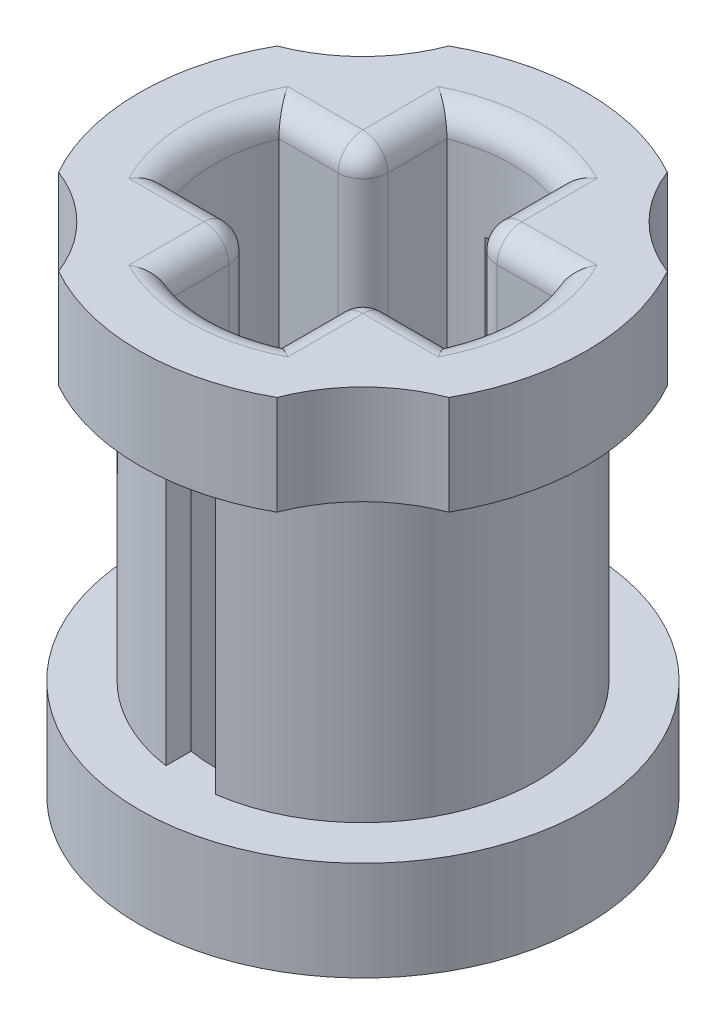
from build123d import *

# Parameters (mm, degrees)
BOSS_EXTRUDE1_DEPTH      = 4
BOSS_EXTRUDE1_DEPTH_BACK = 4
SKETCH1_R                = 3.6
CUT_EXTRUDE1_DEPTH       = 10.482615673
FILLET1_R                = 0.4
FILLET2_R                = 0.4
CUT_EXTRUDE2_DEPTH       = 2.4
CUT_EXTRUDE2_DEPTH_BACK  = 2.4
SKETCH3_R                = 3.6
SKETCH3_R_2              = 2.8
CUT_EXTRUDE3_DEPTH       = 7.474565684
CUT_EXTRUDE3_DEPTH_BACK  = 7.474565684
SKETCH4_W                = 0.8
SKETCH4_H                = 4.8
CUT_EXTRUDE4_DEPTH       = 1.6


with BuildPart() as part:
    # Sketch1 → Boss-Extrude1 (new, two sides: drawn at the far end of the back side and taken through both)
    with BuildSketch(Plane(origin=(0, 0, 0), x_dir=(1, 0, 0), z_dir=(0, 1, 0)).offset(-BOSS_EXTRUDE1_DEPTH_BACK)):
        with Locations(Location((0, 0, 0), (0, 0, 270))):
            Circle(SKETCH1_R)
    extrude(amount=BOSS_EXTRUDE1_DEPTH + BOSS_EXTRUDE1_DEPTH_BACK)

    # Sketch2 → Cut-Extrude1 (cut, through all)
    with BuildSketch(Plane(origin=(0, 4, 0), x_dir=(1, 0, 0), z_dir=(0, 1, 0))):
        with BuildLine():
            Line((-2.232845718, 0.88), (-1.28, 0.88))
            ThreePointArc((-1.28, 0.88), (-0.997157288, 0.997157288), (-0.88, 1.28))
            Line((-0.88, 1.28), (-0.88, 2.232845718))
            ThreePointArc((-0.88, 2.232845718), (0, 2.4), (0.88, 2.232845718))
            Line((0.88, 2.232845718), (0.88, 1.28))
            ThreePointArc((0.88, 1.28), (0.997157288, 0.997157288), (1.28, 0.88))
            Line((1.28, 0.88), (2.232845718, 0.88))
            ThreePointArc((2.232845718, 0.88), (2.4, 0), (2.232845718, -0.88))
            Line((2.232845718, -0.88), (1.28, -0.88))
            ThreePointArc((1.28, -0.88), (0.997157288, -0.997157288), (0.88, -1.28))
            Line((0.88, -1.28), (0.88, -2.232845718))
            ThreePointArc((0.88, -2.232845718), (0, -2.4), (-0.88, -2.232845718))
            Line((-0.88, -2.232845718), (-0.88, -1.28))
            ThreePointArc((-0.88, -1.28), (-0.997157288, -0.997157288), (-1.28, -0.88))
            Line((-1.28, -0.88), (-2.232845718, -0.88))
            ThreePointArc((-2.232845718, -0.88), (-2.4, 0), (-2.232845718, 0.88))
        make_face()
    extrude(amount=-CUT_EXTRUDE1_DEPTH, mode=Mode.SUBTRACT)

    # Fillet1
    fillet1_edges = [part.edges().sort_by_distance(p)[0] for p in [
        (0, 4, -2.4),
        (-0.88, 4, -1.756422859),
        (-0.997157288, 4, -0.997157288),
        (-1.756422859, 4, -0.88),
        (-2.4, 4, 0),
        (-1.756422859, 4, 0.88),
        (-0.997157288, 4, 0.997157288),
        (-0.88, 4, 1.756422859),
        (0, 4, 2.4),
        (0.88, 4, 1.756422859),
        (0.997157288, 4, 0.997157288),
        (1.756422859, 4, 0.88),
        (2.4, 4, 0),
        (1.756422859, 4, -0.88),
        (0.997157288, 4, -0.997157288),
        (0.88, 4, -1.756422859),
    ]]
    fillet(fillet1_edges, radius=FILLET1_R)

    # Fillet2
    fillet2_edges = [part.edges().sort_by_distance(p)[0] for p in [
        (0, -4, -2.4),
        (0.88, -4, -1.756422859),
        (0.997157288, -4, -0.997157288),
        (1.756422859, -4, -0.88),
        (2.4, -4, 0),
        (1.756422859, -4, 0.88),
        (0.997157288, -4, 0.997157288),
        (0.88, -4, 1.756422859),
        (0, -4, 2.4),
        (-0.88, -4, 1.756422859),
        (-0.997157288, -4, 0.997157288),
        (-1.756422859, -4, 0.88),
        (-2.4, -4, 0),
        (-1.756422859, -4, -0.88),
        (-0.997157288, -4, -0.997157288),
        (-0.88, -4, -1.756422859),
    ]]
    fillet(fillet2_edges, radius=FILLET2_R)

    # Sketch3 → Cut-Extrude2 (cut, two sides: drawn at the far end of the back side and taken through both)
    with BuildSketch(Plane(origin=(0, 0, 0), x_dir=(1, 0, 0), z_dir=(0, 1, 0)).offset(-CUT_EXTRUDE2_DEPTH_BACK)):
        with Locations(Location((0, 0, 0), (0, 0, 270))):
            Circle(SKETCH3_R)
        with Locations(Location((0, 0, 0), (0, 0, 270))):
            Circle(SKETCH3_R_2, mode=Mode.SUBTRACT)
    extrude(amount=CUT_EXTRUDE2_DEPTH + CUT_EXTRUDE2_DEPTH_BACK, mode=Mode.SUBTRACT)

    # Sketch4 → Cut-Extrude3 (cut, two sides: drawn at the far end of the back side and taken through both)
    with BuildSketch(Plane.XY.offset(-CUT_EXTRUDE3_DEPTH_BACK)):
        Rectangle(SKETCH4_W, SKETCH4_H)
    extrude(amount=CUT_EXTRUDE3_DEPTH + CUT_EXTRUDE3_DEPTH_BACK, mode=Mode.SUBTRACT)

    # Sketch5 → Cut-Extrude4 (cut)
    with BuildSketch(Plane(origin=(0, 4, 0), x_dir=(1, 0, 0), z_dir=(0, 1, 0))):
        with BuildLine():
            ThreePointArc((1.758986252, 3.141013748), (2.302943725, 2.302943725), (3.141013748, 1.758986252))
            ThreePointArc((3.141013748, 1.758986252), (2.545584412, 2.545584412), (1.758986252, 3.141013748))
        make_face()
        with BuildLine():
            ThreePointArc((3.141013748, -1.758986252), (2.302943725, -2.302943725), (1.758986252, -3.141013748))
            ThreePointArc((1.758986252, -3.141013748), (2.545584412, -2.545584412), (3.141013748, -1.758986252))
        make_face()
        with BuildLine():
            ThreePointArc((-3.141013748, 1.758986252), (-2.302943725, 2.302943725), (-1.758986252, 3.141013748))
            ThreePointArc((-1.758986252, 3.141013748), (-2.545584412, 2.545584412), (-3.141013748, 1.758986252))
        make_face()
        with BuildLine():
            ThreePointArc((-1.758986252, -3.141013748), (-2.302943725, -2.302943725), (-3.141013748, -1.758986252))
            ThreePointArc((-3.141013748, -1.758986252), (-2.545584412, -2.545584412), (-1.758986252, -3.141013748))
        make_face()
    extrude(amount=-CUT_EXTRUDE4_DEPTH, mode=Mode.SUBTRACT)


solid = part.part
